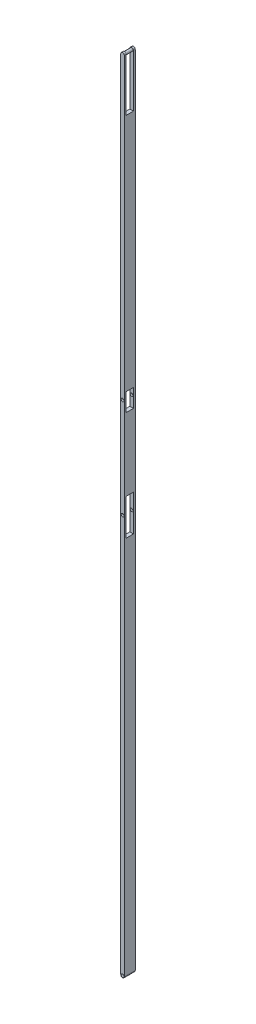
from build123d import *

# Parameters (mm, degrees)
AUFSATZ_LINEAR_AUSTRAGEN1_DEPTH = 30
SKIZZE3_W                       = 20
SKIZZE3_H                       = 50
SCHNITT_LINEAR_AUSTRAGEN1_DEPTH = 2206.226745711
SKIZZE11_R                      = 4
SCHNITT_LINEAR_AUSTRAGEN8_DEPTH = 2206.209740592
SKIZZE5_R                       = 4
SCHNITT_LINEAR_AUSTRAGEN3_DEPTH = 2206.209740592
SKIZZE6_W                       = 20
SKIZZE6_H                       = 100
SCHNITT_LINEAR_AUSTRAGEN4_DEPTH = 2206.226745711
SKIZZE7_R                       = 4
SCHNITT_LINEAR_AUSTRAGEN5_DEPTH = 2206.209740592
SKIZZE9_W                       = 20
SKIZZE9_H                       = 150
SCHNITT_LINEAR_AUSTRAGEN7_DEPTH = 2206.226745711
SKIZZE10_R                      = 4
AUFSATZ_LINEAR_AUSTRAGEN2_DEPTH = 25


with BuildPart() as part:
    # Skizze2 → Aufsatz-Linear austragen1 (new body)
    with BuildSketch(Plane.XY):
        with BuildLine():
            Line((-5, 0), (-5, 2200))
            ThreePointArc((-5, 2200), (0, 2205), (5, 2200))
            Line((5, 2200), (5, 0))
            ThreePointArc((5, 0), (0, -5), (-5, 0))
        make_face()
    extrude(amount=AUFSATZ_LINEAR_AUSTRAGEN1_DEPTH)

    # Skizze3 → Schnitt-Linear austragen1 (cut, through all)
    with BuildSketch(Plane(origin=(5, 0, 0), x_dir=(0, 0, -1), z_dir=(1, 0, 0))):
        with Locations((-15, 1370)):
            Rectangle(SKIZZE3_W, SKIZZE3_H)
    extrude(amount=-SCHNITT_LINEAR_AUSTRAGEN1_DEPTH, mode=Mode.SUBTRACT)

    # Skizze11 → Schnitt-Linear austragen8 (cut, through all)
    with BuildSketch(Plane(origin=(0, 0, 0), x_dir=(-1, 0, 0), z_dir=(0, 0, -1))):
        with Locations((0, 1375)):
            Circle(SKIZZE11_R)
    extrude(amount=-SCHNITT_LINEAR_AUSTRAGEN8_DEPTH, mode=Mode.SUBTRACT)

    # Skizze5 → Schnitt-Linear austragen3 (cut, through all)
    with BuildSketch(Plane(origin=(0, 0, 0), x_dir=(-1, 0, 0), z_dir=(0, 0, -1))):
        with Locations((0, 1100)):
            Circle(SKIZZE5_R)
    extrude(amount=-SCHNITT_LINEAR_AUSTRAGEN3_DEPTH, mode=Mode.SUBTRACT)

    # Skizze6 → Schnitt-Linear austragen4 (cut, through all)
    with BuildSketch(Plane(origin=(5, 0, 0), x_dir=(0, 0, -1), z_dir=(1, 0, 0))):
        with Locations((-15, 1095)):
            Rectangle(SKIZZE6_W, SKIZZE6_H)
    extrude(amount=-SCHNITT_LINEAR_AUSTRAGEN4_DEPTH, mode=Mode.SUBTRACT)

    # Skizze7 → Schnitt-Linear austragen5 (cut, through all)
    with BuildSketch(Plane.XY.offset(30)):
        Circle(SKIZZE7_R)
    extrude(amount=-SCHNITT_LINEAR_AUSTRAGEN5_DEPTH, mode=Mode.SUBTRACT)

    # Skizze9 → Schnitt-Linear austragen7 (cut, through all)
    with BuildSketch(Plane.ZY.offset(5)):
        with Locations((15, 2130)):
            Rectangle(SKIZZE9_W, SKIZZE9_H)
    extrude(amount=-SCHNITT_LINEAR_AUSTRAGEN7_DEPTH, mode=Mode.SUBTRACT)

    # Skizze10 → Aufsatz-Linear austragen2 (add)
    with BuildSketch(Plane(origin=(0, 0, 0), x_dir=(-1, 0, 0), z_dir=(0, 0, -1))):
        with Locations(Location((0, 2200, 0), (0, 0, 90))):
            Circle(SKIZZE10_R)
    extrude(amount=-AUFSATZ_LINEAR_AUSTRAGEN2_DEPTH)


solid = part.part
